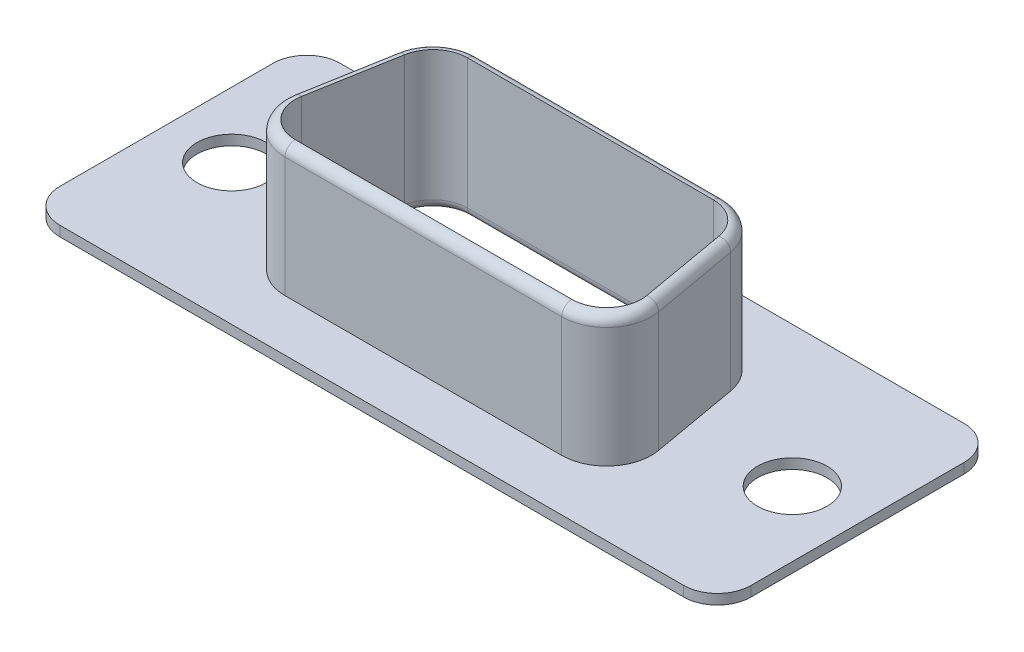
ISO-10303-21;
HEADER;
FILE_DESCRIPTION(('STEP AP214'),'2;1');
FILE_NAME('part.step','',(''),(''),'','','');
FILE_SCHEMA(('AUTOMOTIVE_DESIGN { 1 0 10303 214 1 1 1 1 }'));
ENDSEC;
DATA;
#1=APPLICATION_CONTEXT('core data for automotive mechanical design processes');
#2=APPLICATION_PROTOCOL_DEFINITION('international standard','automotive_design',2000,#1);
#3=PRODUCT_CONTEXT('',#1,'mechanical');
#4=PRODUCT('Part','Part','',(#3));
#5=PRODUCT_RELATED_PRODUCT_CATEGORY('part','',(#4));
#6=PRODUCT_DEFINITION_FORMATION('','',#4);
#7=PRODUCT_DEFINITION_CONTEXT('part definition',#1,'design');
#8=PRODUCT_DEFINITION('design','',#6,#7);
#9=PRODUCT_DEFINITION_SHAPE('','',#8);
#10=(LENGTH_UNIT() NAMED_UNIT(*) SI_UNIT(.MILLI.,.METRE.));
#11=(NAMED_UNIT(*) PLANE_ANGLE_UNIT() SI_UNIT($,.RADIAN.));
#12=(NAMED_UNIT(*) SI_UNIT($,.STERADIAN.) SOLID_ANGLE_UNIT());
#13=UNCERTAINTY_MEASURE_WITH_UNIT(LENGTH_MEASURE(1.E-05),#10,'distance_accuracy_value','');
#14=(GEOMETRIC_REPRESENTATION_CONTEXT(3) GLOBAL_UNCERTAINTY_ASSIGNED_CONTEXT((#13)) GLOBAL_UNIT_ASSIGNED_CONTEXT((#10,
#11,#12)) REPRESENTATION_CONTEXT('',''));
#15=CARTESIAN_POINT('',(0.,0.,0.));
#16=DIRECTION('',(0.,0.,1.));
#17=DIRECTION('',(1.,0.,0.));
#18=AXIS2_PLACEMENT_3D('',#15,#16,#17);
#19=CARTESIAN_POINT('',(6.165,6.25,1.95));
#20=DIRECTION('',(0.,-1.,0.));
#21=DIRECTION('',(1.,0.,0.));
#22=AXIS2_PLACEMENT_3D('',#19,#20,#21);
#23=CYLINDRICAL_SURFACE('',#22,1.55);
#24=CARTESIAN_POINT('',(6.165,0.45,1.95));
#25=DIRECTION('',(0.,1.,0.));
#26=DIRECTION('',(0.,0.,-1.));
#27=AXIS2_PLACEMENT_3D('',#24,#25,#26);
#28=CIRCLE('',#27,1.55);
#29=CARTESIAN_POINT('',(6.165,0.45,3.5));
#30=VERTEX_POINT('',#29);
#31=CARTESIAN_POINT('',(7.69145201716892,0.449999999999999,1.68084532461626));
#32=VERTEX_POINT('',#31);
#33=EDGE_CURVE('E192',#30,#32,#28,.T.);
#34=ORIENTED_EDGE('',*,*,#33,.F.);
#35=DIRECTION('',(0.,-1.,0.));
#36=VECTOR('',#35,1.);
#37=CARTESIAN_POINT('',(6.165,6.25,3.5));
#38=LINE('',#37,#36);
#39=CARTESIAN_POINT('',(6.165,6.25,3.5));
#40=VERTEX_POINT('',#39);
#41=EDGE_CURVE('E195',#30,#40,#38,.F.);
#42=ORIENTED_EDGE('',*,*,#41,.T.);
#43=CARTESIAN_POINT('',(6.165,6.25,1.95));
#44=DIRECTION('',(0.,-1.,0.));
#45=DIRECTION('',(0.,0.,1.));
#46=AXIS2_PLACEMENT_3D('',#43,#44,#45);
#47=CIRCLE('',#46,1.55);
#48=CARTESIAN_POINT('',(7.69145201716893,6.25,1.68084532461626));
#49=VERTEX_POINT('',#48);
#50=EDGE_CURVE('E500',#49,#40,#47,.T.);
#51=ORIENTED_EDGE('',*,*,#50,.F.);
#52=DIRECTION('',(0.,1.,0.));
#53=VECTOR('',#52,1.);
#54=CARTESIAN_POINT('',(7.69145201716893,6.25,1.68084532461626));
#55=LINE('',#54,#53);
#56=EDGE_CURVE('E198',#49,#32,#55,.F.);
#57=ORIENTED_EDGE('',*,*,#56,.T.);
#58=EDGE_LOOP('',(#34,#42,#51,#57));
#59=FACE_BOUND('',#58,.T.);
#60=ADVANCED_FACE('F19',(#59),#23,.F.);
#61=CARTESIAN_POINT('',(6.165,6.25,3.5));
#62=DIRECTION('',(0.,0.,1.));
#63=DIRECTION('',(0.,-1.,0.));
#64=AXIS2_PLACEMENT_3D('',#61,#62,#63);
#65=PLANE('',#64);
#66=DIRECTION('',(-1.,0.,0.));
#67=VECTOR('',#66,1.);
#68=CARTESIAN_POINT('',(6.165,0.45,3.5));
#69=LINE('',#68,#67);
#70=CARTESIAN_POINT('',(-6.165,0.450000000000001,3.5));
#71=VERTEX_POINT('',#70);
#72=EDGE_CURVE('E213',#71,#30,#69,.F.);
#73=ORIENTED_EDGE('',*,*,#72,.F.);
#74=DIRECTION('',(0.,-1.,0.));
#75=VECTOR('',#74,1.);
#76=CARTESIAN_POINT('',(-6.165,6.25,3.5));
#77=LINE('',#76,#75);
#78=CARTESIAN_POINT('',(-6.165,6.25,3.5));
#79=VERTEX_POINT('',#78);
#80=EDGE_CURVE('E222',#71,#79,#77,.F.);
#81=ORIENTED_EDGE('',*,*,#80,.T.);
#82=DIRECTION('',(1.,0.,0.));
#83=VECTOR('',#82,1.);
#84=CARTESIAN_POINT('',(6.165,6.25,3.5));
#85=LINE('',#84,#83);
#86=EDGE_CURVE('E220',#40,#79,#85,.F.);
#87=ORIENTED_EDGE('',*,*,#86,.F.);
#88=ORIENTED_EDGE('',*,*,#41,.F.);
#89=EDGE_LOOP('',(#73,#81,#87,#88));
#90=FACE_BOUND('',#89,.T.);
#91=ADVANCED_FACE('F217',(#90),#65,.F.);
#92=CARTESIAN_POINT('',(-6.165,6.25,1.95));
#93=DIRECTION('',(0.,-1.,0.));
#94=DIRECTION('',(1.,0.,0.));
#95=AXIS2_PLACEMENT_3D('',#92,#93,#94);
#96=CYLINDRICAL_SURFACE('',#95,1.55);
#97=CARTESIAN_POINT('',(-6.165,0.45,1.95));
#98=DIRECTION('',(0.,1.,0.));
#99=DIRECTION('',(0.,0.,-1.));
#100=AXIS2_PLACEMENT_3D('',#97,#98,#99);
#101=CIRCLE('',#100,1.55);
#102=CARTESIAN_POINT('',(-7.69145201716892,0.450000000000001,1.68084532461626));
#103=VERTEX_POINT('',#102);
#104=EDGE_CURVE('E229',#103,#71,#101,.T.);
#105=ORIENTED_EDGE('',*,*,#104,.F.);
#106=DIRECTION('',(0.,1.,0.));
#107=VECTOR('',#106,1.);
#108=CARTESIAN_POINT('',(-7.69145201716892,6.25,1.68084532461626));
#109=LINE('',#108,#107);
#110=CARTESIAN_POINT('',(-7.69145201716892,6.25,1.68084532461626));
#111=VERTEX_POINT('',#110);
#112=EDGE_CURVE('E635',#103,#111,#109,.T.);
#113=ORIENTED_EDGE('',*,*,#112,.T.);
#114=CARTESIAN_POINT('',(-6.165,6.25,1.95));
#115=DIRECTION('',(0.,-1.,0.));
#116=DIRECTION('',(0.,0.,1.));
#117=AXIS2_PLACEMENT_3D('',#114,#115,#116);
#118=CIRCLE('',#117,1.55);
#119=EDGE_CURVE('E460',#79,#111,#118,.T.);
#120=ORIENTED_EDGE('',*,*,#119,.F.);
#121=ORIENTED_EDGE('',*,*,#80,.F.);
#122=EDGE_LOOP('',(#105,#113,#120,#121));
#123=FACE_BOUND('',#122,.T.);
#124=ADVANCED_FACE('F676',(#123),#96,.F.);
#125=CARTESIAN_POINT('',(-7.69145201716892,6.25,1.68084532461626));
#126=DIRECTION('',(-0.984807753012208,0.,-0.17364817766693));
#127=DIRECTION('',(-0.17364817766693,0.,0.984807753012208));
#128=AXIS2_PLACEMENT_3D('',#125,#126,#127);
#129=PLANE('',#128);
#130=DIRECTION('',(0.17364817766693,0.,-0.984807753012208));
#131=VECTOR('',#130,1.);
#132=CARTESIAN_POINT('',(-7.69145201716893,0.450000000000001,1.68084532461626));
#133=LINE('',#132,#131);
#134=CARTESIAN_POINT('',(-7.00377679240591,0.450000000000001,-2.21915467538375));
#135=VERTEX_POINT('',#134);
#136=EDGE_CURVE('E528',#135,#103,#133,.F.);
#137=ORIENTED_EDGE('',*,*,#136,.F.);
#138=DIRECTION('',(0.,-1.,0.));
#139=VECTOR('',#138,1.);
#140=CARTESIAN_POINT('',(-7.00377679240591,6.25,-2.21915467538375));
#141=LINE('',#140,#139);
#142=CARTESIAN_POINT('',(-7.00377679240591,6.25,-2.21915467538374));
#143=VERTEX_POINT('',#142);
#144=EDGE_CURVE('E627',#135,#143,#141,.F.);
#145=ORIENTED_EDGE('',*,*,#144,.T.);
#146=DIRECTION('',(-0.17364817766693,0.,0.984807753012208));
#147=VECTOR('',#146,1.);
#148=CARTESIAN_POINT('',(-7.69145201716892,6.25,1.68084532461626));
#149=LINE('',#148,#147);
#150=EDGE_CURVE('E447',#111,#143,#149,.F.);
#151=ORIENTED_EDGE('',*,*,#150,.F.);
#152=ORIENTED_EDGE('',*,*,#112,.F.);
#153=EDGE_LOOP('',(#137,#145,#151,#152));
#154=FACE_BOUND('',#153,.T.);
#155=ADVANCED_FACE('F1155',(#154),#129,.F.);
#156=CARTESIAN_POINT('',(-5.47732477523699,6.25,-1.95));
#157=DIRECTION('',(0.,-1.,0.));
#158=DIRECTION('',(1.,0.,0.));
#159=AXIS2_PLACEMENT_3D('',#156,#157,#158);
#160=CYLINDRICAL_SURFACE('',#159,1.55);
#161=CARTESIAN_POINT('',(-5.47732477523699,0.450000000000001,-1.95));
#162=DIRECTION('',(0.,1.,0.));
#163=DIRECTION('',(0.,0.,-1.));
#164=AXIS2_PLACEMENT_3D('',#161,#162,#163);
#165=CIRCLE('',#164,1.55);
#166=CARTESIAN_POINT('',(-5.47732477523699,0.45,-3.5));
#167=VERTEX_POINT('',#166);
#168=EDGE_CURVE('E507',#167,#135,#165,.T.);
#169=ORIENTED_EDGE('',*,*,#168,.F.);
#170=DIRECTION('',(0.,1.,0.));
#171=VECTOR('',#170,1.);
#172=CARTESIAN_POINT('',(-5.47732477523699,6.25,-3.5));
#173=LINE('',#172,#171);
#174=CARTESIAN_POINT('',(-5.47732477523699,6.25,-3.5));
#175=VERTEX_POINT('',#174);
#176=EDGE_CURVE('E617',#167,#175,#173,.T.);
#177=ORIENTED_EDGE('',*,*,#176,.T.);
#178=CARTESIAN_POINT('',(-5.47732477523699,6.25,-1.95));
#179=DIRECTION('',(0.,-1.,0.));
#180=DIRECTION('',(0.,0.,1.));
#181=AXIS2_PLACEMENT_3D('',#178,#179,#180);
#182=CIRCLE('',#181,1.55);
#183=EDGE_CURVE('E446',#143,#175,#182,.T.);
#184=ORIENTED_EDGE('',*,*,#183,.F.);
#185=ORIENTED_EDGE('',*,*,#144,.F.);
#186=EDGE_LOOP('',(#169,#177,#184,#185));
#187=FACE_BOUND('',#186,.T.);
#188=ADVANCED_FACE('F1145',(#187),#160,.F.);
#189=CARTESIAN_POINT('',(-5.47732477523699,6.25,-3.5));
#190=DIRECTION('',(0.,0.,-1.));
#191=DIRECTION('',(-1.,0.,0.));
#192=AXIS2_PLACEMENT_3D('',#189,#190,#191);
#193=PLANE('',#192);
#194=DIRECTION('',(1.,0.,0.));
#195=VECTOR('',#194,1.);
#196=CARTESIAN_POINT('',(-5.47732477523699,0.45,-3.5));
#197=LINE('',#196,#195);
#198=CARTESIAN_POINT('',(5.47732477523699,0.45,-3.5));
#199=VERTEX_POINT('',#198);
#200=EDGE_CURVE('E501',#199,#167,#197,.F.);
#201=ORIENTED_EDGE('',*,*,#200,.F.);
#202=DIRECTION('',(0.,-1.,0.));
#203=VECTOR('',#202,1.);
#204=CARTESIAN_POINT('',(5.47732477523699,6.25,-3.5));
#205=LINE('',#204,#203);
#206=CARTESIAN_POINT('',(5.47732477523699,6.25,-3.5));
#207=VERTEX_POINT('',#206);
#208=EDGE_CURVE('E613',#199,#207,#205,.F.);
#209=ORIENTED_EDGE('',*,*,#208,.T.);
#210=DIRECTION('',(-1.,0.,0.));
#211=VECTOR('',#210,1.);
#212=CARTESIAN_POINT('',(-5.47732477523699,6.25,-3.5));
#213=LINE('',#212,#211);
#214=EDGE_CURVE('E620',#175,#207,#213,.F.);
#215=ORIENTED_EDGE('',*,*,#214,.F.);
#216=ORIENTED_EDGE('',*,*,#176,.F.);
#217=EDGE_LOOP('',(#201,#209,#215,#216));
#218=FACE_BOUND('',#217,.T.);
#219=ADVANCED_FACE('F1136',(#218),#193,.F.);
#220=CARTESIAN_POINT('',(5.47732477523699,6.25,-1.95));
#221=DIRECTION('',(0.,-1.,0.));
#222=DIRECTION('',(1.,0.,0.));
#223=AXIS2_PLACEMENT_3D('',#220,#221,#222);
#224=CYLINDRICAL_SURFACE('',#223,1.55);
#225=CARTESIAN_POINT('',(5.47732477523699,0.45,-1.95));
#226=DIRECTION('',(0.,1.,0.));
#227=DIRECTION('',(0.,0.,-1.));
#228=AXIS2_PLACEMENT_3D('',#225,#226,#227);
#229=CIRCLE('',#228,1.55);
#230=CARTESIAN_POINT('',(7.00377679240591,0.449999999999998,-2.21915467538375));
#231=VERTEX_POINT('',#230);
#232=EDGE_CURVE('E243',#231,#199,#229,.T.);
#233=ORIENTED_EDGE('',*,*,#232,.F.);
#234=DIRECTION('',(0.,1.,0.));
#235=VECTOR('',#234,1.);
#236=CARTESIAN_POINT('',(7.00377679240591,6.25,-2.21915467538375));
#237=LINE('',#236,#235);
#238=CARTESIAN_POINT('',(7.00377679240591,6.25,-2.21915467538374));
#239=VERTEX_POINT('',#238);
#240=EDGE_CURVE('E604',#231,#239,#237,.T.);
#241=ORIENTED_EDGE('',*,*,#240,.T.);
#242=CARTESIAN_POINT('',(5.47732477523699,6.25,-1.95));
#243=DIRECTION('',(0.,-1.,0.));
#244=DIRECTION('',(0.,0.,1.));
#245=AXIS2_PLACEMENT_3D('',#242,#243,#244);
#246=CIRCLE('',#245,1.55);
#247=EDGE_CURVE('E406',#207,#239,#246,.T.);
#248=ORIENTED_EDGE('',*,*,#247,.F.);
#249=ORIENTED_EDGE('',*,*,#208,.F.);
#250=EDGE_LOOP('',(#233,#241,#248,#249));
#251=FACE_BOUND('',#250,.T.);
#252=ADVANCED_FACE('F1127',(#251),#224,.F.);
#253=CARTESIAN_POINT('',(7.00377679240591,6.25,-2.21915467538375));
#254=DIRECTION('',(0.984807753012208,0.,-0.173648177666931));
#255=DIRECTION('',(-0.173648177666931,0.,-0.984807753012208));
#256=AXIS2_PLACEMENT_3D('',#253,#254,#255);
#257=PLANE('',#256);
#258=DIRECTION('',(0.173648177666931,0.,0.984807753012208));
#259=VECTOR('',#258,1.);
#260=CARTESIAN_POINT('',(7.00377679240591,0.449999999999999,-2.21915467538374));
#261=LINE('',#260,#259);
#262=EDGE_CURVE('E239',#32,#231,#261,.F.);
#263=ORIENTED_EDGE('',*,*,#262,.F.);
#264=ORIENTED_EDGE('',*,*,#56,.F.);
#265=DIRECTION('',(-0.173648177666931,0.,-0.984807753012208));
#266=VECTOR('',#265,1.);
#267=CARTESIAN_POINT('',(7.00377679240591,6.25,-2.21915467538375));
#268=LINE('',#267,#266);
#269=EDGE_CURVE('E411',#239,#49,#268,.F.);
#270=ORIENTED_EDGE('',*,*,#269,.F.);
#271=ORIENTED_EDGE('',*,*,#240,.F.);
#272=EDGE_LOOP('',(#263,#264,#270,#271));
#273=FACE_BOUND('',#272,.T.);
#274=ADVANCED_FACE('F585',(#273),#257,.F.);
#275=CARTESIAN_POINT('',(5.47732477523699,0.45,-1.95));
#276=DIRECTION('',(0.,1.,0.));
#277=DIRECTION('',(0.,0.,-1.));
#278=AXIS2_PLACEMENT_3D('',#275,#276,#277);
#279=TOROIDAL_SURFACE('',#278,2.,0.45);
#280=CARTESIAN_POINT('',(5.47732477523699,0.45,-3.95));
#281=DIRECTION('',(1.,0.,0.));
#282=DIRECTION('',(0.,0.,-1.));
#283=AXIS2_PLACEMENT_3D('',#280,#281,#282);
#284=CIRCLE('',#283,0.45);
#285=CARTESIAN_POINT('',(5.47732477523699,0.,-3.95));
#286=VERTEX_POINT('',#285);
#287=EDGE_CURVE('E504',#286,#199,#284,.F.);
#288=ORIENTED_EDGE('',*,*,#287,.F.);
#289=CARTESIAN_POINT('',(5.47732477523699,0.,-1.95));
#290=DIRECTION('',(0.,-1.,0.));
#291=DIRECTION('',(0.,0.,-1.));
#292=AXIS2_PLACEMENT_3D('',#289,#290,#291);
#293=CIRCLE('',#292,2.);
#294=CARTESIAN_POINT('',(7.4469402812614,0.,-2.29729635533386));
#295=VERTEX_POINT('',#294);
#296=EDGE_CURVE('E321',#286,#295,#293,.T.);
#297=ORIENTED_EDGE('',*,*,#296,.T.);
#298=CARTESIAN_POINT('',(7.4469402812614,0.45,-2.29729635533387));
#299=DIRECTION('',(0.173648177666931,0.,0.984807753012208));
#300=DIRECTION('',(0.984807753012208,0.,-0.173648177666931));
#301=AXIS2_PLACEMENT_3D('',#298,#299,#300);
#302=CIRCLE('',#301,0.45);
#303=EDGE_CURVE('E242',#231,#295,#302,.T.);
#304=ORIENTED_EDGE('',*,*,#303,.F.);
#305=ORIENTED_EDGE('',*,*,#232,.T.);
#306=EDGE_LOOP('',(#288,#297,#304,#305));
#307=FACE_BOUND('',#306,.T.);
#308=ADVANCED_FACE('F581',(#307),#279,.T.);
#309=CARTESIAN_POINT('',(7.4469402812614,0.45,-2.29729635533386));
#310=DIRECTION('',(0.173648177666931,0.,0.984807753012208));
#311=DIRECTION('',(0.984807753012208,0.,-0.173648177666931));
#312=AXIS2_PLACEMENT_3D('',#309,#310,#311);
#313=CYLINDRICAL_SURFACE('',#312,0.45);
#314=ORIENTED_EDGE('',*,*,#303,.T.);
#315=DIRECTION('',(0.173648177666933,0.,0.984807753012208));
#316=VECTOR('',#315,1.);
#317=CARTESIAN_POINT('',(7.4469402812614,0.,-2.29729635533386));
#318=LINE('',#317,#316);
#319=CARTESIAN_POINT('',(8.13461550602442,0.,1.60270364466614));
#320=VERTEX_POINT('',#319);
#321=EDGE_CURVE('E386',#295,#320,#318,.T.);
#322=ORIENTED_EDGE('',*,*,#321,.T.);
#323=CARTESIAN_POINT('',(8.13461550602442,0.449999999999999,1.60270364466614));
#324=DIRECTION('',(-0.173648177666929,0.,-0.984807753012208));
#325=DIRECTION('',(0.984807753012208,0.,-0.173648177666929));
#326=AXIS2_PLACEMENT_3D('',#323,#324,#325);
#327=CIRCLE('',#326,0.45);
#328=EDGE_CURVE('E203',#32,#320,#327,.F.);
#329=ORIENTED_EDGE('',*,*,#328,.F.);
#330=ORIENTED_EDGE('',*,*,#262,.T.);
#331=EDGE_LOOP('',(#314,#322,#329,#330));
#332=FACE_BOUND('',#331,.T.);
#333=ADVANCED_FACE('F561',(#332),#313,.T.);
#334=CARTESIAN_POINT('',(6.165,0.45,1.95));
#335=DIRECTION('',(0.,1.,0.));
#336=DIRECTION('',(0.,0.,-1.));
#337=AXIS2_PLACEMENT_3D('',#334,#335,#336);
#338=TOROIDAL_SURFACE('',#337,2.,0.45);
#339=CARTESIAN_POINT('',(6.165,0.45,3.95));
#340=DIRECTION('',(-1.,0.,0.));
#341=DIRECTION('',(0.,0.,1.));
#342=AXIS2_PLACEMENT_3D('',#339,#340,#341);
#343=CIRCLE('',#342,0.45);
#344=CARTESIAN_POINT('',(6.165,0.,3.95));
#345=VERTEX_POINT('',#344);
#346=EDGE_CURVE('E202',#30,#345,#343,.T.);
#347=ORIENTED_EDGE('',*,*,#346,.F.);
#348=ORIENTED_EDGE('',*,*,#33,.T.);
#349=ORIENTED_EDGE('',*,*,#328,.T.);
#350=CARTESIAN_POINT('',(6.165,0.,1.95));
#351=DIRECTION('',(0.,-1.,0.));
#352=DIRECTION('',(0.984807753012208,0.,-0.173648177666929));
#353=AXIS2_PLACEMENT_3D('',#350,#351,#352);
#354=CIRCLE('',#353,2.);
#355=EDGE_CURVE('E208',#320,#345,#354,.T.);
#356=ORIENTED_EDGE('',*,*,#355,.T.);
#357=EDGE_LOOP('',(#347,#348,#349,#356));
#358=FACE_BOUND('',#357,.T.);
#359=ADVANCED_FACE('F206',(#358),#338,.T.);
#360=CARTESIAN_POINT('',(6.165,0.45,3.95));
#361=DIRECTION('',(-1.,0.,0.));
#362=DIRECTION('',(0.,0.,1.));
#363=AXIS2_PLACEMENT_3D('',#360,#361,#362);
#364=CYLINDRICAL_SURFACE('',#363,0.45);
#365=CARTESIAN_POINT('',(-6.165,0.450000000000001,3.95));
#366=DIRECTION('',(1.,0.,0.));
#367=DIRECTION('',(0.,0.,1.));
#368=AXIS2_PLACEMENT_3D('',#365,#366,#367);
#369=CIRCLE('',#368,0.45);
#370=CARTESIAN_POINT('',(-6.165,0.,3.95));
#371=VERTEX_POINT('',#370);
#372=EDGE_CURVE('E226',#71,#371,#369,.F.);
#373=ORIENTED_EDGE('',*,*,#372,.F.);
#374=ORIENTED_EDGE('',*,*,#72,.T.);
#375=ORIENTED_EDGE('',*,*,#346,.T.);
#376=DIRECTION('',(1.,0.,0.));
#377=VECTOR('',#376,1.);
#378=CARTESIAN_POINT('',(15.405,0.,3.95));
#379=LINE('',#378,#377);
#380=EDGE_CURVE('E377',#345,#371,#379,.F.);
#381=ORIENTED_EDGE('',*,*,#380,.T.);
#382=EDGE_LOOP('',(#373,#374,#375,#381));
#383=FACE_BOUND('',#382,.T.);
#384=ADVANCED_FACE('F224',(#383),#364,.T.);
#385=CARTESIAN_POINT('',(-6.165,0.45,1.95));
#386=DIRECTION('',(0.,1.,0.));
#387=DIRECTION('',(0.,0.,-1.));
#388=AXIS2_PLACEMENT_3D('',#385,#386,#387);
#389=TOROIDAL_SURFACE('',#388,2.,0.45);
#390=CARTESIAN_POINT('',(-8.13461550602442,0.450000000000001,1.60270364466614));
#391=DIRECTION('',(0.17364817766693,0.,-0.984807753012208));
#392=DIRECTION('',(-0.984807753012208,0.,-0.17364817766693));
#393=AXIS2_PLACEMENT_3D('',#390,#391,#392);
#394=CIRCLE('',#393,0.45);
#395=CARTESIAN_POINT('',(-8.13461550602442,0.,1.60270364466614));
#396=VERTEX_POINT('',#395);
#397=EDGE_CURVE('E531',#103,#396,#394,.T.);
#398=ORIENTED_EDGE('',*,*,#397,.F.);
#399=ORIENTED_EDGE('',*,*,#104,.T.);
#400=ORIENTED_EDGE('',*,*,#372,.T.);
#401=CARTESIAN_POINT('',(-6.165,0.,1.95));
#402=DIRECTION('',(0.,-1.,0.));
#403=DIRECTION('',(0.,0.,1.));
#404=AXIS2_PLACEMENT_3D('',#401,#402,#403);
#405=CIRCLE('',#404,2.);
#406=EDGE_CURVE('E361',#371,#396,#405,.T.);
#407=ORIENTED_EDGE('',*,*,#406,.T.);
#408=EDGE_LOOP('',(#398,#399,#400,#407));
#409=FACE_BOUND('',#408,.T.);
#410=ADVANCED_FACE('F538',(#409),#389,.T.);
#411=CARTESIAN_POINT('',(-8.13461550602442,0.450000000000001,1.60270364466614));
#412=DIRECTION('',(0.17364817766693,0.,-0.984807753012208));
#413=DIRECTION('',(-0.984807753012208,0.,-0.17364817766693));
#414=AXIS2_PLACEMENT_3D('',#411,#412,#413);
#415=CYLINDRICAL_SURFACE('',#414,0.45);
#416=CARTESIAN_POINT('',(-7.4469402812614,0.450000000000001,-2.29729635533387));
#417=DIRECTION('',(-0.173648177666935,0.,0.984807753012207));
#418=DIRECTION('',(-0.984807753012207,0.,-0.173648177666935));
#419=AXIS2_PLACEMENT_3D('',#416,#417,#418);
#420=CIRCLE('',#419,0.45);
#421=CARTESIAN_POINT('',(-7.4469402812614,0.,-2.29729635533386));
#422=VERTEX_POINT('',#421);
#423=EDGE_CURVE('E521',#135,#422,#420,.F.);
#424=ORIENTED_EDGE('',*,*,#423,.F.);
#425=ORIENTED_EDGE('',*,*,#136,.T.);
#426=ORIENTED_EDGE('',*,*,#397,.T.);
#427=DIRECTION('',(0.173648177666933,0.,-0.984807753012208));
#428=VECTOR('',#427,1.);
#429=CARTESIAN_POINT('',(-8.13461550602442,0.,1.60270364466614));
#430=LINE('',#429,#428);
#431=EDGE_CURVE('E369',#396,#422,#430,.T.);
#432=ORIENTED_EDGE('',*,*,#431,.T.);
#433=EDGE_LOOP('',(#424,#425,#426,#432));
#434=FACE_BOUND('',#433,.T.);
#435=ADVANCED_FACE('F516',(#434),#415,.T.);
#436=CARTESIAN_POINT('',(-5.47732477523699,0.45,-1.95));
#437=DIRECTION('',(0.,1.,0.));
#438=DIRECTION('',(0.,0.,-1.));
#439=AXIS2_PLACEMENT_3D('',#436,#437,#438);
#440=TOROIDAL_SURFACE('',#439,2.,0.45);
#441=CARTESIAN_POINT('',(-5.47732477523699,0.45,-3.95));
#442=DIRECTION('',(1.,0.,0.));
#443=DIRECTION('',(0.,0.,-1.));
#444=AXIS2_PLACEMENT_3D('',#441,#442,#443);
#445=CIRCLE('',#444,0.45);
#446=CARTESIAN_POINT('',(-5.47732477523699,0.,-3.95));
#447=VERTEX_POINT('',#446);
#448=EDGE_CURVE('E498',#167,#447,#445,.T.);
#449=ORIENTED_EDGE('',*,*,#448,.F.);
#450=ORIENTED_EDGE('',*,*,#168,.T.);
#451=ORIENTED_EDGE('',*,*,#423,.T.);
#452=CARTESIAN_POINT('',(-5.47732477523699,0.,-1.95));
#453=DIRECTION('',(0.,-1.,0.));
#454=DIRECTION('',(-0.984807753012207,0.,-0.173648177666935));
#455=AXIS2_PLACEMENT_3D('',#452,#453,#454);
#456=CIRCLE('',#455,2.);
#457=EDGE_CURVE('E118',#422,#447,#456,.T.);
#458=ORIENTED_EDGE('',*,*,#457,.T.);
#459=EDGE_LOOP('',(#449,#450,#451,#458));
#460=FACE_BOUND('',#459,.T.);
#461=ADVANCED_FACE('F512',(#460),#440,.T.);
#462=CARTESIAN_POINT('',(-5.47732477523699,0.45,-3.95));
#463=DIRECTION('',(1.,0.,0.));
#464=DIRECTION('',(0.,0.,-1.));
#465=AXIS2_PLACEMENT_3D('',#462,#463,#464);
#466=CYLINDRICAL_SURFACE('',#465,0.45);
#467=ORIENTED_EDGE('',*,*,#448,.T.);
#468=DIRECTION('',(1.,0.,0.));
#469=VECTOR('',#468,1.);
#470=CARTESIAN_POINT('',(15.405,0.,-3.95));
#471=LINE('',#470,#469);
#472=EDGE_CURVE('E371',#447,#286,#471,.T.);
#473=ORIENTED_EDGE('',*,*,#472,.T.);
#474=ORIENTED_EDGE('',*,*,#287,.T.);
#475=ORIENTED_EDGE('',*,*,#200,.T.);
#476=EDGE_LOOP('',(#467,#473,#474,#475));
#477=FACE_BOUND('',#476,.T.);
#478=ADVANCED_FACE('F485',(#477),#466,.T.);
#479=CARTESIAN_POINT('',(6.165,5.8,1.95));
#480=DIRECTION('',(0.,-1.,0.));
#481=DIRECTION('',(0.,0.,1.));
#482=AXIS2_PLACEMENT_3D('',#479,#480,#481);
#483=TOROIDAL_SURFACE('',#482,1.55,0.45);
#484=CARTESIAN_POINT('',(6.165,5.8,3.5));
#485=DIRECTION('',(1.,0.,0.));
#486=DIRECTION('',(0.,0.,-1.));
#487=AXIS2_PLACEMENT_3D('',#484,#485,#486);
#488=CIRCLE('',#487,0.45);
#489=CARTESIAN_POINT('',(6.165,5.8,3.95));
#490=VERTEX_POINT('',#489);
#491=EDGE_CURVE('E609',#490,#40,#488,.F.);
#492=ORIENTED_EDGE('',*,*,#491,.F.);
#493=CARTESIAN_POINT('',(6.165,5.8,1.95));
#494=DIRECTION('',(0.,-1.,0.));
#495=DIRECTION('',(1.,0.,0.));
#496=AXIS2_PLACEMENT_3D('',#493,#494,#495);
#497=CIRCLE('',#496,2.);
#498=CARTESIAN_POINT('',(8.13461550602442,5.8,1.60270364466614));
#499=VERTEX_POINT('',#498);
#500=EDGE_CURVE('E390',#499,#490,#497,.T.);
#501=ORIENTED_EDGE('',*,*,#500,.F.);
#502=CARTESIAN_POINT('',(7.69145201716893,5.8,1.68084532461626));
#503=DIRECTION('',(-0.173648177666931,0.,-0.984807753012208));
#504=DIRECTION('',(-0.984807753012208,0.,0.173648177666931));
#505=AXIS2_PLACEMENT_3D('',#502,#503,#504);
#506=CIRCLE('',#505,0.45);
#507=EDGE_CURVE('E402',#49,#499,#506,.T.);
#508=ORIENTED_EDGE('',*,*,#507,.F.);
#509=ORIENTED_EDGE('',*,*,#50,.T.);
#510=EDGE_LOOP('',(#492,#501,#508,#509));
#511=FACE_BOUND('',#510,.T.);
#512=ADVANCED_FACE('F480',(#511),#483,.T.);
#513=CARTESIAN_POINT('',(6.165,5.8,3.5));
#514=DIRECTION('',(1.,0.,0.));
#515=DIRECTION('',(0.,0.,-1.));
#516=AXIS2_PLACEMENT_3D('',#513,#514,#515);
#517=CYLINDRICAL_SURFACE('',#516,0.45);
#518=CARTESIAN_POINT('',(-6.165,5.8,3.5));
#519=DIRECTION('',(-1.,0.,0.));
#520=DIRECTION('',(0.,0.,1.));
#521=AXIS2_PLACEMENT_3D('',#518,#519,#520);
#522=CIRCLE('',#521,0.45);
#523=CARTESIAN_POINT('',(-6.165,5.8,3.95));
#524=VERTEX_POINT('',#523);
#525=EDGE_CURVE('E471',#524,#79,#522,.T.);
#526=ORIENTED_EDGE('',*,*,#525,.F.);
#527=DIRECTION('',(1.,0.,0.));
#528=VECTOR('',#527,1.);
#529=CARTESIAN_POINT('',(6.165,5.8,3.95));
#530=LINE('',#529,#528);
#531=EDGE_CURVE('E684',#490,#524,#530,.F.);
#532=ORIENTED_EDGE('',*,*,#531,.F.);
#533=ORIENTED_EDGE('',*,*,#491,.T.);
#534=ORIENTED_EDGE('',*,*,#86,.T.);
#535=EDGE_LOOP('',(#526,#532,#533,#534));
#536=FACE_BOUND('',#535,.T.);
#537=ADVANCED_FACE('F476',(#536),#517,.T.);
#538=CARTESIAN_POINT('',(-6.165,5.8,1.95));
#539=DIRECTION('',(0.,-1.,0.));
#540=DIRECTION('',(0.,0.,1.));
#541=AXIS2_PLACEMENT_3D('',#538,#539,#540);
#542=TOROIDAL_SURFACE('',#541,1.55,0.45);
#543=CARTESIAN_POINT('',(-7.69145201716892,5.8,1.68084532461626));
#544=DIRECTION('',(-0.17364817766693,0.,0.984807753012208));
#545=DIRECTION('',(0.984807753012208,0.,0.17364817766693));
#546=AXIS2_PLACEMENT_3D('',#543,#544,#545);
#547=CIRCLE('',#546,0.45);
#548=CARTESIAN_POINT('',(-8.13461550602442,5.8,1.60270364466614));
#549=VERTEX_POINT('',#548);
#550=EDGE_CURVE('E457',#549,#111,#547,.F.);
#551=ORIENTED_EDGE('',*,*,#550,.F.);
#552=CARTESIAN_POINT('',(-6.165,5.8,1.95));
#553=DIRECTION('',(0.,-1.,0.));
#554=DIRECTION('',(1.,0.,0.));
#555=AXIS2_PLACEMENT_3D('',#552,#553,#554);
#556=CIRCLE('',#555,2.);
#557=EDGE_CURVE('E463',#524,#549,#556,.T.);
#558=ORIENTED_EDGE('',*,*,#557,.F.);
#559=ORIENTED_EDGE('',*,*,#525,.T.);
#560=ORIENTED_EDGE('',*,*,#119,.T.);
#561=EDGE_LOOP('',(#551,#558,#559,#560));
#562=FACE_BOUND('',#561,.T.);
#563=ADVANCED_FACE('F473',(#562),#542,.T.);
#564=CARTESIAN_POINT('',(-7.69145201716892,5.8,1.68084532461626));
#565=DIRECTION('',(-0.17364817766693,0.,0.984807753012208));
#566=DIRECTION('',(0.984807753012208,0.,0.17364817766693));
#567=AXIS2_PLACEMENT_3D('',#564,#565,#566);
#568=CYLINDRICAL_SURFACE('',#567,0.45);
#569=CARTESIAN_POINT('',(-7.00377679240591,5.8,-2.21915467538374));
#570=DIRECTION('',(0.17364817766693,0.,-0.984807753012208));
#571=DIRECTION('',(-0.984807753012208,0.,-0.17364817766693));
#572=AXIS2_PLACEMENT_3D('',#569,#570,#571);
#573=CIRCLE('',#572,0.45);
#574=CARTESIAN_POINT('',(-7.44694028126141,5.8,-2.29729635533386));
#575=VERTEX_POINT('',#574);
#576=EDGE_CURVE('E443',#575,#143,#573,.T.);
#577=ORIENTED_EDGE('',*,*,#576,.F.);
#578=DIRECTION('',(-0.17364817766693,0.,0.984807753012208));
#579=VECTOR('',#578,1.);
#580=CARTESIAN_POINT('',(-8.13461550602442,5.8,1.60270364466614));
#581=LINE('',#580,#579);
#582=EDGE_CURVE('E450',#549,#575,#581,.F.);
#583=ORIENTED_EDGE('',*,*,#582,.F.);
#584=ORIENTED_EDGE('',*,*,#550,.T.);
#585=ORIENTED_EDGE('',*,*,#150,.T.);
#586=EDGE_LOOP('',(#577,#583,#584,#585));
#587=FACE_BOUND('',#586,.T.);
#588=ADVANCED_FACE('F435',(#587),#568,.T.);
#589=CARTESIAN_POINT('',(-5.47732477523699,5.8,-1.95));
#590=DIRECTION('',(0.,-1.,0.));
#591=DIRECTION('',(0.,0.,1.));
#592=AXIS2_PLACEMENT_3D('',#589,#590,#591);
#593=TOROIDAL_SURFACE('',#592,1.55,0.45);
#594=CARTESIAN_POINT('',(-5.47732477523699,5.8,-3.5));
#595=DIRECTION('',(-1.,0.,0.));
#596=DIRECTION('',(0.,0.,1.));
#597=AXIS2_PLACEMENT_3D('',#594,#595,#596);
#598=CIRCLE('',#597,0.45);
#599=CARTESIAN_POINT('',(-5.47732477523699,5.8,-3.95));
#600=VERTEX_POINT('',#599);
#601=EDGE_CURVE('E623',#600,#175,#598,.F.);
#602=ORIENTED_EDGE('',*,*,#601,.F.);
#603=CARTESIAN_POINT('',(-5.47732477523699,5.8,-1.95));
#604=DIRECTION('',(0.,-1.,0.));
#605=DIRECTION('',(1.,0.,0.));
#606=AXIS2_PLACEMENT_3D('',#603,#604,#605);
#607=CIRCLE('',#606,2.);
#608=EDGE_CURVE('E744',#575,#600,#607,.T.);
#609=ORIENTED_EDGE('',*,*,#608,.F.);
#610=ORIENTED_EDGE('',*,*,#576,.T.);
#611=ORIENTED_EDGE('',*,*,#183,.T.);
#612=EDGE_LOOP('',(#602,#609,#610,#611));
#613=FACE_BOUND('',#612,.T.);
#614=ADVANCED_FACE('F430',(#613),#593,.T.);
#615=CARTESIAN_POINT('',(-5.47732477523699,5.8,-3.5));
#616=DIRECTION('',(-1.,0.,0.));
#617=DIRECTION('',(0.,0.,1.));
#618=AXIS2_PLACEMENT_3D('',#615,#616,#617);
#619=CYLINDRICAL_SURFACE('',#618,0.45);
#620=ORIENTED_EDGE('',*,*,#601,.T.);
#621=ORIENTED_EDGE('',*,*,#214,.T.);
#622=CARTESIAN_POINT('',(5.47732477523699,5.8,-3.5));
#623=DIRECTION('',(1.,0.,0.));
#624=DIRECTION('',(0.,0.,-1.));
#625=AXIS2_PLACEMENT_3D('',#622,#623,#624);
#626=CIRCLE('',#625,0.45);
#627=CARTESIAN_POINT('',(5.47732477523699,5.8,-3.95));
#628=VERTEX_POINT('',#627);
#629=EDGE_CURVE('E421',#628,#207,#626,.T.);
#630=ORIENTED_EDGE('',*,*,#629,.F.);
#631=DIRECTION('',(-1.,0.,0.));
#632=VECTOR('',#631,1.);
#633=CARTESIAN_POINT('',(-5.47732477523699,5.8,-3.95));
#634=LINE('',#633,#632);
#635=EDGE_CURVE('E738',#600,#628,#634,.F.);
#636=ORIENTED_EDGE('',*,*,#635,.F.);
#637=EDGE_LOOP('',(#620,#621,#630,#636));
#638=FACE_BOUND('',#637,.T.);
#639=ADVANCED_FACE('F426',(#638),#619,.T.);
#640=CARTESIAN_POINT('',(5.47732477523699,5.8,-1.95));
#641=DIRECTION('',(0.,-1.,0.));
#642=DIRECTION('',(0.,0.,1.));
#643=AXIS2_PLACEMENT_3D('',#640,#641,#642);
#644=TOROIDAL_SURFACE('',#643,1.55,0.45);
#645=ORIENTED_EDGE('',*,*,#629,.T.);
#646=ORIENTED_EDGE('',*,*,#247,.T.);
#647=CARTESIAN_POINT('',(7.00377679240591,5.8,-2.21915467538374));
#648=DIRECTION('',(-0.173648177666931,0.,-0.984807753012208));
#649=DIRECTION('',(-0.984807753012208,0.,0.173648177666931));
#650=AXIS2_PLACEMENT_3D('',#647,#648,#649);
#651=CIRCLE('',#650,0.45);
#652=CARTESIAN_POINT('',(7.4469402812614,5.8,-2.29729635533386));
#653=VERTEX_POINT('',#652);
#654=EDGE_CURVE('E405',#653,#239,#651,.F.);
#655=ORIENTED_EDGE('',*,*,#654,.F.);
#656=CARTESIAN_POINT('',(5.47732477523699,5.8,-1.95));
#657=DIRECTION('',(0.,-1.,0.));
#658=DIRECTION('',(1.,0.,0.));
#659=AXIS2_PLACEMENT_3D('',#656,#657,#658);
#660=CIRCLE('',#659,2.);
#661=EDGE_CURVE('E414',#628,#653,#660,.T.);
#662=ORIENTED_EDGE('',*,*,#661,.F.);
#663=EDGE_LOOP('',(#645,#646,#655,#662));
#664=FACE_BOUND('',#663,.T.);
#665=ADVANCED_FACE('F423',(#664),#644,.T.);
#666=CARTESIAN_POINT('',(7.00377679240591,5.8,-2.21915467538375));
#667=DIRECTION('',(-0.173648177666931,0.,-0.984807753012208));
#668=DIRECTION('',(-0.984807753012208,0.,0.173648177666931));
#669=AXIS2_PLACEMENT_3D('',#666,#667,#668);
#670=CYLINDRICAL_SURFACE('',#669,0.45);
#671=ORIENTED_EDGE('',*,*,#654,.T.);
#672=ORIENTED_EDGE('',*,*,#269,.T.);
#673=ORIENTED_EDGE('',*,*,#507,.T.);
#674=DIRECTION('',(-0.173648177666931,0.,-0.984807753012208));
#675=VECTOR('',#674,1.);
#676=CARTESIAN_POINT('',(7.4469402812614,5.8,-2.29729635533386));
#677=LINE('',#676,#675);
#678=EDGE_CURVE('E397',#653,#499,#677,.F.);
#679=ORIENTED_EDGE('',*,*,#678,.F.);
#680=EDGE_LOOP('',(#671,#672,#673,#679));
#681=FACE_BOUND('',#680,.T.);
#682=ADVANCED_FACE('F338',(#681),#670,.T.);
#683=CARTESIAN_POINT('',(15.405,0.,6.25));
#684=DIRECTION('',(0.,1.,0.));
#685=DIRECTION('',(0.,0.,1.));
#686=AXIS2_PLACEMENT_3D('',#683,#684,#685);
#687=PLANE('',#686);
#688=CARTESIAN_POINT('',(-12.495,0.,0.));
#689=DIRECTION('',(0.,-1.,0.));
#690=DIRECTION('',(1.,0.,0.));
#691=AXIS2_PLACEMENT_3D('',#688,#689,#690);
#692=CIRCLE('',#691,1.55);
#693=CARTESIAN_POINT('',(-10.945,0.,0.));
#694=VERTEX_POINT('',#693);
#695=EDGE_CURVE('E280',#694,#694,#692,.F.);
#696=ORIENTED_EDGE('',*,*,#695,.T.);
#697=EDGE_LOOP('',(#696));
#698=FACE_BOUND('',#697,.T.);
#699=CARTESIAN_POINT('',(12.495,0.,0.));
#700=DIRECTION('',(0.,-1.,0.));
#701=DIRECTION('',(1.,0.,0.));
#702=AXIS2_PLACEMENT_3D('',#699,#700,#701);
#703=CIRCLE('',#702,1.55);
#704=CARTESIAN_POINT('',(14.045,0.,0.));
#705=VERTEX_POINT('',#704);
#706=EDGE_CURVE('E283',#705,#705,#703,.F.);
#707=ORIENTED_EDGE('',*,*,#706,.T.);
#708=EDGE_LOOP('',(#707));
#709=FACE_BOUND('',#708,.T.);
#710=ORIENTED_EDGE('',*,*,#457,.F.);
#711=ORIENTED_EDGE('',*,*,#431,.F.);
#712=ORIENTED_EDGE('',*,*,#406,.F.);
#713=ORIENTED_EDGE('',*,*,#380,.F.);
#714=ORIENTED_EDGE('',*,*,#355,.F.);
#715=ORIENTED_EDGE('',*,*,#321,.F.);
#716=ORIENTED_EDGE('',*,*,#296,.F.);
#717=ORIENTED_EDGE('',*,*,#472,.F.);
#718=EDGE_LOOP('',(#710,#711,#712,#713,#714,#715,#716,#717));
#719=FACE_BOUND('',#718,.T.);
#720=CARTESIAN_POINT('',(-13.905,0.,-4.75));
#721=DIRECTION('',(0.,-1.,0.));
#722=DIRECTION('',(1.,0.,0.));
#723=AXIS2_PLACEMENT_3D('',#720,#721,#722);
#724=CIRCLE('',#723,1.5);
#725=CARTESIAN_POINT('',(-13.905,0.,-6.25));
#726=VERTEX_POINT('',#725);
#727=CARTESIAN_POINT('',(-15.405,0.,-4.75));
#728=VERTEX_POINT('',#727);
#729=EDGE_CURVE('E22',#726,#728,#724,.F.);
#730=ORIENTED_EDGE('',*,*,#729,.F.);
#731=DIRECTION('',(-1.,0.,0.));
#732=VECTOR('',#731,1.);
#733=CARTESIAN_POINT('',(15.405,0.,-6.25));
#734=LINE('',#733,#732);
#735=CARTESIAN_POINT('',(13.905,0.,-6.25));
#736=VERTEX_POINT('',#735);
#737=EDGE_CURVE('E372',#736,#726,#734,.T.);
#738=ORIENTED_EDGE('',*,*,#737,.F.);
#739=CARTESIAN_POINT('',(13.905,0.,-4.75));
#740=DIRECTION('',(0.,1.,0.));
#741=DIRECTION('',(-1.,0.,0.));
#742=AXIS2_PLACEMENT_3D('',#739,#740,#741);
#743=CIRCLE('',#742,1.5);
#744=CARTESIAN_POINT('',(15.405,0.,-4.75));
#745=VERTEX_POINT('',#744);
#746=EDGE_CURVE('E287',#745,#736,#743,.T.);
#747=ORIENTED_EDGE('',*,*,#746,.F.);
#748=DIRECTION('',(0.,0.,-1.));
#749=VECTOR('',#748,1.);
#750=CARTESIAN_POINT('',(15.405,0.,6.25));
#751=LINE('',#750,#749);
#752=CARTESIAN_POINT('',(15.405,0.,4.75));
#753=VERTEX_POINT('',#752);
#754=EDGE_CURVE('E493',#753,#745,#751,.T.);
#755=ORIENTED_EDGE('',*,*,#754,.F.);
#756=CARTESIAN_POINT('',(13.905,0.,4.75));
#757=DIRECTION('',(0.,-1.,0.));
#758=DIRECTION('',(1.,0.,0.));
#759=AXIS2_PLACEMENT_3D('',#756,#757,#758);
#760=CIRCLE('',#759,1.5);
#761=CARTESIAN_POINT('',(13.905,0.,6.25));
#762=VERTEX_POINT('',#761);
#763=EDGE_CURVE('E292',#762,#753,#760,.F.);
#764=ORIENTED_EDGE('',*,*,#763,.F.);
#765=DIRECTION('',(-1.,0.,0.));
#766=VECTOR('',#765,1.);
#767=CARTESIAN_POINT('',(15.405,0.,6.25));
#768=LINE('',#767,#766);
#769=CARTESIAN_POINT('',(-13.905,0.,6.25));
#770=VERTEX_POINT('',#769);
#771=EDGE_CURVE('E295',#762,#770,#768,.T.);
#772=ORIENTED_EDGE('',*,*,#771,.T.);
#773=CARTESIAN_POINT('',(-13.905,0.,4.75));
#774=DIRECTION('',(0.,1.,0.));
#775=DIRECTION('',(-1.,0.,0.));
#776=AXIS2_PLACEMENT_3D('',#773,#774,#775);
#777=CIRCLE('',#776,1.5);
#778=CARTESIAN_POINT('',(-15.405,0.,4.75));
#779=VERTEX_POINT('',#778);
#780=EDGE_CURVE('E296',#779,#770,#777,.T.);
#781=ORIENTED_EDGE('',*,*,#780,.F.);
#782=DIRECTION('',(0.,0.,-1.));
#783=VECTOR('',#782,1.);
#784=CARTESIAN_POINT('',(-15.405,0.,6.25));
#785=LINE('',#784,#783);
#786=EDGE_CURVE('E304',#779,#728,#785,.T.);
#787=ORIENTED_EDGE('',*,*,#786,.T.);
#788=EDGE_LOOP('',(#730,#738,#747,#755,#764,#772,#781,#787));
#789=FACE_BOUND('',#788,.T.);
#790=ADVANCED_FACE('F327',(#698,#709,#719,#789),#687,.F.);
#791=CARTESIAN_POINT('',(15.405,0.,-6.25));
#792=DIRECTION('',(0.,0.,-1.));
#793=DIRECTION('',(-1.,0.,0.));
#794=AXIS2_PLACEMENT_3D('',#791,#792,#793);
#795=PLANE('',#794);
#796=DIRECTION('',(1.,0.,0.));
#797=VECTOR('',#796,1.);
#798=CARTESIAN_POINT('',(15.405,0.449999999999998,-6.25));
#799=LINE('',#798,#797);
#800=CARTESIAN_POINT('',(13.905,0.449999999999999,-6.25));
#801=VERTEX_POINT('',#800);
#802=CARTESIAN_POINT('',(-13.905,0.450000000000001,-6.25));
#803=VERTEX_POINT('',#802);
#804=EDGE_CURVE('E279',#801,#803,#799,.F.);
#805=ORIENTED_EDGE('',*,*,#804,.F.);
#806=DIRECTION('',(0.,1.,0.));
#807=VECTOR('',#806,1.);
#808=CARTESIAN_POINT('',(13.905,0.,-6.25));
#809=LINE('',#808,#807);
#810=EDGE_CURVE('E290',#736,#801,#809,.T.);
#811=ORIENTED_EDGE('',*,*,#810,.F.);
#812=ORIENTED_EDGE('',*,*,#737,.T.);
#813=DIRECTION('',(0.,-1.,0.));
#814=VECTOR('',#813,1.);
#815=CARTESIAN_POINT('',(-13.905,0.,-6.25));
#816=LINE('',#815,#814);
#817=EDGE_CURVE('E310',#803,#726,#816,.T.);
#818=ORIENTED_EDGE('',*,*,#817,.F.);
#819=EDGE_LOOP('',(#805,#811,#812,#818));
#820=FACE_BOUND('',#819,.T.);
#821=ADVANCED_FACE('F337',(#820),#795,.T.);
#822=CARTESIAN_POINT('',(-13.905,0.,-4.75));
#823=DIRECTION('',(0.,-1.,0.));
#824=DIRECTION('',(1.,0.,0.));
#825=AXIS2_PLACEMENT_3D('',#822,#823,#824);
#826=CYLINDRICAL_SURFACE('',#825,1.5);
#827=CARTESIAN_POINT('',(-13.905,0.450000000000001,-4.75));
#828=DIRECTION('',(0.,-1.,0.));
#829=DIRECTION('',(1.,0.,0.));
#830=AXIS2_PLACEMENT_3D('',#827,#828,#829);
#831=CIRCLE('',#830,1.5);
#832=CARTESIAN_POINT('',(-15.405,0.45,-4.75));
#833=VERTEX_POINT('',#832);
#834=EDGE_CURVE('E276',#803,#833,#831,.F.);
#835=ORIENTED_EDGE('',*,*,#834,.F.);
#836=ORIENTED_EDGE('',*,*,#817,.T.);
#837=ORIENTED_EDGE('',*,*,#729,.T.);
#838=DIRECTION('',(0.,1.,0.));
#839=VECTOR('',#838,1.);
#840=CARTESIAN_POINT('',(-15.405,0.,-4.75));
#841=LINE('',#840,#839);
#842=EDGE_CURVE('E298',#728,#833,#841,.T.);
#843=ORIENTED_EDGE('',*,*,#842,.T.);
#844=EDGE_LOOP('',(#835,#836,#837,#843));
#845=FACE_BOUND('',#844,.T.);
#846=ADVANCED_FACE('F797',(#845),#826,.T.);
#847=CARTESIAN_POINT('',(-15.405,0.,6.25));
#848=DIRECTION('',(1.,0.,0.));
#849=DIRECTION('',(0.,0.,-1.));
#850=AXIS2_PLACEMENT_3D('',#847,#848,#849);
#851=PLANE('',#850);
#852=ORIENTED_EDGE('',*,*,#842,.F.);
#853=ORIENTED_EDGE('',*,*,#786,.F.);
#854=DIRECTION('',(0.,1.,0.));
#855=VECTOR('',#854,1.);
#856=CARTESIAN_POINT('',(-15.405,0.,4.75));
#857=LINE('',#856,#855);
#858=CARTESIAN_POINT('',(-15.405,0.450000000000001,4.75));
#859=VERTEX_POINT('',#858);
#860=EDGE_CURVE('E297',#859,#779,#857,.F.);
#861=ORIENTED_EDGE('',*,*,#860,.F.);
#862=DIRECTION('',(0.,0.,1.));
#863=VECTOR('',#862,1.);
#864=CARTESIAN_POINT('',(-15.405,0.449999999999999,6.25));
#865=LINE('',#864,#863);
#866=EDGE_CURVE('E275',#833,#859,#865,.T.);
#867=ORIENTED_EDGE('',*,*,#866,.F.);
#868=EDGE_LOOP('',(#852,#853,#861,#867));
#869=FACE_BOUND('',#868,.T.);
#870=ADVANCED_FACE('F799',(#869),#851,.F.);
#871=CARTESIAN_POINT('',(-13.905,0.,4.75));
#872=DIRECTION('',(0.,1.,0.));
#873=DIRECTION('',(-1.,0.,0.));
#874=AXIS2_PLACEMENT_3D('',#871,#872,#873);
#875=CYLINDRICAL_SURFACE('',#874,1.5);
#876=CARTESIAN_POINT('',(-13.905,0.450000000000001,4.75));
#877=DIRECTION('',(0.,1.,0.));
#878=DIRECTION('',(-1.,0.,0.));
#879=AXIS2_PLACEMENT_3D('',#876,#877,#878);
#880=CIRCLE('',#879,1.5);
#881=CARTESIAN_POINT('',(-13.905,0.45,6.25));
#882=VERTEX_POINT('',#881);
#883=EDGE_CURVE('E272',#859,#882,#880,.T.);
#884=ORIENTED_EDGE('',*,*,#883,.F.);
#885=ORIENTED_EDGE('',*,*,#860,.T.);
#886=ORIENTED_EDGE('',*,*,#780,.T.);
#887=DIRECTION('',(0.,1.,0.));
#888=VECTOR('',#887,1.);
#889=CARTESIAN_POINT('',(-13.905,0.,6.25));
#890=LINE('',#889,#888);
#891=EDGE_CURVE('E302',#770,#882,#890,.T.);
#892=ORIENTED_EDGE('',*,*,#891,.T.);
#893=EDGE_LOOP('',(#884,#885,#886,#892));
#894=FACE_BOUND('',#893,.T.);
#895=ADVANCED_FACE('F712',(#894),#875,.T.);
#896=CARTESIAN_POINT('',(15.405,0.,6.25));
#897=DIRECTION('',(0.,0.,-1.));
#898=DIRECTION('',(-1.,0.,0.));
#899=AXIS2_PLACEMENT_3D('',#896,#897,#898);
#900=PLANE('',#899);
#901=DIRECTION('',(0.,-1.,0.));
#902=VECTOR('',#901,1.);
#903=CARTESIAN_POINT('',(13.905,0.,6.25));
#904=LINE('',#903,#902);
#905=CARTESIAN_POINT('',(13.905,0.449999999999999,6.25));
#906=VERTEX_POINT('',#905);
#907=EDGE_CURVE('E294',#906,#762,#904,.T.);
#908=ORIENTED_EDGE('',*,*,#907,.F.);
#909=DIRECTION('',(1.,0.,0.));
#910=VECTOR('',#909,1.);
#911=CARTESIAN_POINT('',(15.405,0.449999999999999,6.25));
#912=LINE('',#911,#910);
#913=EDGE_CURVE('E271',#882,#906,#912,.T.);
#914=ORIENTED_EDGE('',*,*,#913,.F.);
#915=ORIENTED_EDGE('',*,*,#891,.F.);
#916=ORIENTED_EDGE('',*,*,#771,.F.);
#917=EDGE_LOOP('',(#908,#914,#915,#916));
#918=FACE_BOUND('',#917,.T.);
#919=ADVANCED_FACE('F717',(#918),#900,.F.);
#920=CARTESIAN_POINT('',(13.905,0.,4.75));
#921=DIRECTION('',(0.,-1.,0.));
#922=DIRECTION('',(1.,0.,0.));
#923=AXIS2_PLACEMENT_3D('',#920,#921,#922);
#924=CYLINDRICAL_SURFACE('',#923,1.5);
#925=CARTESIAN_POINT('',(13.905,0.449999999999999,4.75));
#926=DIRECTION('',(0.,-1.,0.));
#927=DIRECTION('',(1.,0.,0.));
#928=AXIS2_PLACEMENT_3D('',#925,#926,#927);
#929=CIRCLE('',#928,1.5);
#930=CARTESIAN_POINT('',(15.405,0.449999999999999,4.75));
#931=VERTEX_POINT('',#930);
#932=EDGE_CURVE('E268',#906,#931,#929,.F.);
#933=ORIENTED_EDGE('',*,*,#932,.F.);
#934=ORIENTED_EDGE('',*,*,#907,.T.);
#935=ORIENTED_EDGE('',*,*,#763,.T.);
#936=DIRECTION('',(0.,1.,0.));
#937=VECTOR('',#936,1.);
#938=CARTESIAN_POINT('',(15.405,0.,4.75));
#939=LINE('',#938,#937);
#940=EDGE_CURVE('E291',#931,#753,#939,.F.);
#941=ORIENTED_EDGE('',*,*,#940,.F.);
#942=EDGE_LOOP('',(#933,#934,#935,#941));
#943=FACE_BOUND('',#942,.T.);
#944=ADVANCED_FACE('F849',(#943),#924,.T.);
#945=CARTESIAN_POINT('',(15.405,0.,6.25));
#946=DIRECTION('',(1.,0.,0.));
#947=DIRECTION('',(0.,0.,-1.));
#948=AXIS2_PLACEMENT_3D('',#945,#946,#947);
#949=PLANE('',#948);
#950=DIRECTION('',(0.,0.,1.));
#951=VECTOR('',#950,1.);
#952=CARTESIAN_POINT('',(15.405,0.449999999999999,6.25));
#953=LINE('',#952,#951);
#954=CARTESIAN_POINT('',(15.405,0.449999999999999,-4.75));
#955=VERTEX_POINT('',#954);
#956=EDGE_CURVE('E267',#931,#955,#953,.F.);
#957=ORIENTED_EDGE('',*,*,#956,.F.);
#958=ORIENTED_EDGE('',*,*,#940,.T.);
#959=ORIENTED_EDGE('',*,*,#754,.T.);
#960=DIRECTION('',(0.,1.,0.));
#961=VECTOR('',#960,1.);
#962=CARTESIAN_POINT('',(15.405,0.,-4.75));
#963=LINE('',#962,#961);
#964=EDGE_CURVE('E394',#955,#745,#963,.F.);
#965=ORIENTED_EDGE('',*,*,#964,.F.);
#966=EDGE_LOOP('',(#957,#958,#959,#965));
#967=FACE_BOUND('',#966,.T.);
#968=ADVANCED_FACE('F792',(#967),#949,.T.);
#969=CARTESIAN_POINT('',(13.905,0.,-4.75));
#970=DIRECTION('',(0.,1.,0.));
#971=DIRECTION('',(-1.,0.,0.));
#972=AXIS2_PLACEMENT_3D('',#969,#970,#971);
#973=CYLINDRICAL_SURFACE('',#972,1.5);
#974=CARTESIAN_POINT('',(13.905,0.449999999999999,-4.75));
#975=DIRECTION('',(0.,1.,0.));
#976=DIRECTION('',(-1.,0.,0.));
#977=AXIS2_PLACEMENT_3D('',#974,#975,#976);
#978=CIRCLE('',#977,1.5);
#979=EDGE_CURVE('E264',#955,#801,#978,.T.);
#980=ORIENTED_EDGE('',*,*,#979,.F.);
#981=ORIENTED_EDGE('',*,*,#964,.T.);
#982=ORIENTED_EDGE('',*,*,#746,.T.);
#983=ORIENTED_EDGE('',*,*,#810,.T.);
#984=EDGE_LOOP('',(#980,#981,#982,#983));
#985=FACE_BOUND('',#984,.T.);
#986=ADVANCED_FACE('F794',(#985),#973,.T.);
#987=CARTESIAN_POINT('',(6.165,6.25,1.95));
#988=DIRECTION('',(0.,-1.,0.));
#989=DIRECTION('',(1.,0.,0.));
#990=AXIS2_PLACEMENT_3D('',#987,#988,#989);
#991=CYLINDRICAL_SURFACE('',#990,2.);
#992=DIRECTION('',(0.,-1.,0.));
#993=VECTOR('',#992,1.);
#994=CARTESIAN_POINT('',(6.165,6.25,3.95));
#995=LINE('',#994,#993);
#996=CARTESIAN_POINT('',(6.165,0.449999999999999,3.95));
#997=VERTEX_POINT('',#996);
#998=EDGE_CURVE('E393',#997,#490,#995,.F.);
#999=ORIENTED_EDGE('',*,*,#998,.F.);
#1000=CARTESIAN_POINT('',(6.165,0.45,1.95));
#1001=DIRECTION('',(0.,-1.,0.));
#1002=DIRECTION('',(1.,0.,0.));
#1003=AXIS2_PLACEMENT_3D('',#1000,#1001,#1002);
#1004=CIRCLE('',#1003,2.);
#1005=CARTESIAN_POINT('',(8.13461550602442,0.45,1.60270364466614));
#1006=VERTEX_POINT('',#1005);
#1007=EDGE_CURVE('E261',#1006,#997,#1004,.T.);
#1008=ORIENTED_EDGE('',*,*,#1007,.F.);
#1009=DIRECTION('',(0.,1.,0.));
#1010=VECTOR('',#1009,1.);
#1011=CARTESIAN_POINT('',(8.13461550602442,6.25,1.60270364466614));
#1012=LINE('',#1011,#1010);
#1013=EDGE_CURVE('E286',#499,#1006,#1012,.F.);
#1014=ORIENTED_EDGE('',*,*,#1013,.F.);
#1015=ORIENTED_EDGE('',*,*,#500,.T.);
#1016=EDGE_LOOP('',(#999,#1008,#1014,#1015));
#1017=FACE_BOUND('',#1016,.T.);
#1018=ADVANCED_FACE('F841',(#1017),#991,.T.);
#1019=CARTESIAN_POINT('',(6.165,6.25,3.95));
#1020=DIRECTION('',(0.,0.,1.));
#1021=DIRECTION('',(0.,-1.,0.));
#1022=AXIS2_PLACEMENT_3D('',#1019,#1020,#1021);
#1023=PLANE('',#1022);
#1024=DIRECTION('',(0.,-1.,0.));
#1025=VECTOR('',#1024,1.);
#1026=CARTESIAN_POINT('',(-6.165,6.25,3.95));
#1027=LINE('',#1026,#1025);
#1028=CARTESIAN_POINT('',(-6.165,0.45,3.95));
#1029=VERTEX_POINT('',#1028);
#1030=EDGE_CURVE('E466',#1029,#524,#1027,.F.);
#1031=ORIENTED_EDGE('',*,*,#1030,.F.);
#1032=DIRECTION('',(1.,0.,0.));
#1033=VECTOR('',#1032,1.);
#1034=CARTESIAN_POINT('',(15.405,0.449999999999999,3.95));
#1035=LINE('',#1034,#1033);
#1036=EDGE_CURVE('E260',#997,#1029,#1035,.F.);
#1037=ORIENTED_EDGE('',*,*,#1036,.F.);
#1038=ORIENTED_EDGE('',*,*,#998,.T.);
#1039=ORIENTED_EDGE('',*,*,#531,.T.);
#1040=EDGE_LOOP('',(#1031,#1037,#1038,#1039));
#1041=FACE_BOUND('',#1040,.T.);
#1042=ADVANCED_FACE('F838',(#1041),#1023,.T.);
#1043=CARTESIAN_POINT('',(-6.165,6.25,1.95));
#1044=DIRECTION('',(0.,-1.,0.));
#1045=DIRECTION('',(1.,0.,0.));
#1046=AXIS2_PLACEMENT_3D('',#1043,#1044,#1045);
#1047=CYLINDRICAL_SURFACE('',#1046,2.);
#1048=DIRECTION('',(0.,1.,0.));
#1049=VECTOR('',#1048,1.);
#1050=CARTESIAN_POINT('',(-8.13461550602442,6.25,1.60270364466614));
#1051=LINE('',#1050,#1049);
#1052=CARTESIAN_POINT('',(-8.13461550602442,0.45,1.60270364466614));
#1053=VERTEX_POINT('',#1052);
#1054=EDGE_CURVE('E454',#1053,#549,#1051,.T.);
#1055=ORIENTED_EDGE('',*,*,#1054,.F.);
#1056=CARTESIAN_POINT('',(-6.165,0.450000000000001,1.95));
#1057=DIRECTION('',(0.,-1.,0.));
#1058=DIRECTION('',(1.,0.,0.));
#1059=AXIS2_PLACEMENT_3D('',#1056,#1057,#1058);
#1060=CIRCLE('',#1059,2.);
#1061=EDGE_CURVE('E257',#1029,#1053,#1060,.T.);
#1062=ORIENTED_EDGE('',*,*,#1061,.F.);
#1063=ORIENTED_EDGE('',*,*,#1030,.T.);
#1064=ORIENTED_EDGE('',*,*,#557,.T.);
#1065=EDGE_LOOP('',(#1055,#1062,#1063,#1064));
#1066=FACE_BOUND('',#1065,.T.);
#1067=ADVANCED_FACE('F766',(#1066),#1047,.T.);
#1068=CARTESIAN_POINT('',(-8.13461550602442,6.25,1.60270364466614));
#1069=DIRECTION('',(-0.984807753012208,0.,-0.17364817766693));
#1070=DIRECTION('',(-0.17364817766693,0.,0.984807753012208));
#1071=AXIS2_PLACEMENT_3D('',#1068,#1069,#1070);
#1072=PLANE('',#1071);
#1073=DIRECTION('',(0.,-1.,0.));
#1074=VECTOR('',#1073,1.);
#1075=CARTESIAN_POINT('',(-7.44694028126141,6.25,-2.29729635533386));
#1076=LINE('',#1075,#1074);
#1077=CARTESIAN_POINT('',(-7.4469402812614,0.450000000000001,-2.29729635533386));
#1078=VERTEX_POINT('',#1077);
#1079=EDGE_CURVE('E453',#1078,#575,#1076,.F.);
#1080=ORIENTED_EDGE('',*,*,#1079,.F.);
#1081=DIRECTION('',(0.173648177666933,0.,-0.984807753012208));
#1082=VECTOR('',#1081,1.);
#1083=CARTESIAN_POINT('',(-8.13461550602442,0.449999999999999,1.60270364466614));
#1084=LINE('',#1083,#1082);
#1085=EDGE_CURVE('E256',#1053,#1078,#1084,.T.);
#1086=ORIENTED_EDGE('',*,*,#1085,.F.);
#1087=ORIENTED_EDGE('',*,*,#1054,.T.);
#1088=ORIENTED_EDGE('',*,*,#582,.T.);
#1089=EDGE_LOOP('',(#1080,#1086,#1087,#1088));
#1090=FACE_BOUND('',#1089,.T.);
#1091=ADVANCED_FACE('F757',(#1090),#1072,.T.);
#1092=CARTESIAN_POINT('',(-5.47732477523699,6.25,-1.95));
#1093=DIRECTION('',(0.,-1.,0.));
#1094=DIRECTION('',(1.,0.,0.));
#1095=AXIS2_PLACEMENT_3D('',#1092,#1093,#1094);
#1096=CYLINDRICAL_SURFACE('',#1095,2.);
#1097=DIRECTION('',(0.,1.,0.));
#1098=VECTOR('',#1097,1.);
#1099=CARTESIAN_POINT('',(-5.47732477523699,6.25,-3.95));
#1100=LINE('',#1099,#1098);
#1101=CARTESIAN_POINT('',(-5.47732477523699,0.449999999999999,-3.95));
#1102=VERTEX_POINT('',#1101);
#1103=EDGE_CURVE('E741',#1102,#600,#1100,.T.);
#1104=ORIENTED_EDGE('',*,*,#1103,.F.);
#1105=CARTESIAN_POINT('',(-5.47732477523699,0.450000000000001,-1.95));
#1106=DIRECTION('',(0.,-1.,0.));
#1107=DIRECTION('',(1.,0.,0.));
#1108=AXIS2_PLACEMENT_3D('',#1105,#1106,#1107);
#1109=CIRCLE('',#1108,2.);
#1110=EDGE_CURVE('E253',#1078,#1102,#1109,.T.);
#1111=ORIENTED_EDGE('',*,*,#1110,.F.);
#1112=ORIENTED_EDGE('',*,*,#1079,.T.);
#1113=ORIENTED_EDGE('',*,*,#608,.T.);
#1114=EDGE_LOOP('',(#1104,#1111,#1112,#1113));
#1115=FACE_BOUND('',#1114,.T.);
#1116=ADVANCED_FACE('F781',(#1115),#1096,.T.);
#1117=CARTESIAN_POINT('',(-5.47732477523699,6.25,-3.95));
#1118=DIRECTION('',(0.,0.,-1.));
#1119=DIRECTION('',(-1.,0.,0.));
#1120=AXIS2_PLACEMENT_3D('',#1117,#1118,#1119);
#1121=PLANE('',#1120);
#1122=DIRECTION('',(0.,-1.,0.));
#1123=VECTOR('',#1122,1.);
#1124=CARTESIAN_POINT('',(5.47732477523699,6.25,-3.95));
#1125=LINE('',#1124,#1123);
#1126=CARTESIAN_POINT('',(5.47732477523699,0.450000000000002,-3.95));
#1127=VERTEX_POINT('',#1126);
#1128=EDGE_CURVE('E416',#1127,#628,#1125,.F.);
#1129=ORIENTED_EDGE('',*,*,#1128,.F.);
#1130=DIRECTION('',(1.,0.,0.));
#1131=VECTOR('',#1130,1.);
#1132=CARTESIAN_POINT('',(15.405,0.449999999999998,-3.95));
#1133=LINE('',#1132,#1131);
#1134=EDGE_CURVE('E252',#1102,#1127,#1133,.T.);
#1135=ORIENTED_EDGE('',*,*,#1134,.F.);
#1136=ORIENTED_EDGE('',*,*,#1103,.T.);
#1137=ORIENTED_EDGE('',*,*,#635,.T.);
#1138=EDGE_LOOP('',(#1129,#1135,#1136,#1137));
#1139=FACE_BOUND('',#1138,.T.);
#1140=ADVANCED_FACE('F828',(#1139),#1121,.T.);
#1141=CARTESIAN_POINT('',(5.47732477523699,6.25,-1.95));
#1142=DIRECTION('',(0.,-1.,0.));
#1143=DIRECTION('',(1.,0.,0.));
#1144=AXIS2_PLACEMENT_3D('',#1141,#1142,#1143);
#1145=CYLINDRICAL_SURFACE('',#1144,2.);
#1146=DIRECTION('',(0.,1.,0.));
#1147=VECTOR('',#1146,1.);
#1148=CARTESIAN_POINT('',(7.4469402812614,6.25,-2.29729635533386));
#1149=LINE('',#1148,#1147);
#1150=CARTESIAN_POINT('',(7.4469402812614,0.450000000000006,-2.29729635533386));
#1151=VERTEX_POINT('',#1150);
#1152=EDGE_CURVE('E37',#1151,#653,#1149,.T.);
#1153=ORIENTED_EDGE('',*,*,#1152,.F.);
#1154=CARTESIAN_POINT('',(5.47732477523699,0.450000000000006,-1.95));
#1155=DIRECTION('',(0.,-1.,0.));
#1156=DIRECTION('',(1.,0.,0.));
#1157=AXIS2_PLACEMENT_3D('',#1154,#1155,#1156);
#1158=CIRCLE('',#1157,2.);
#1159=EDGE_CURVE('E249',#1127,#1151,#1158,.T.);
#1160=ORIENTED_EDGE('',*,*,#1159,.F.);
#1161=ORIENTED_EDGE('',*,*,#1128,.T.);
#1162=ORIENTED_EDGE('',*,*,#661,.T.);
#1163=EDGE_LOOP('',(#1153,#1160,#1161,#1162));
#1164=FACE_BOUND('',#1163,.T.);
#1165=ADVANCED_FACE('F824',(#1164),#1145,.T.);
#1166=CARTESIAN_POINT('',(7.4469402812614,6.25,-2.29729635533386));
#1167=DIRECTION('',(0.984807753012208,0.,-0.173648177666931));
#1168=DIRECTION('',(-0.173648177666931,0.,-0.984807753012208));
#1169=AXIS2_PLACEMENT_3D('',#1166,#1167,#1168);
#1170=PLANE('',#1169);
#1171=ORIENTED_EDGE('',*,*,#1013,.T.);
#1172=DIRECTION('',(0.17364817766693,0.,0.984807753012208));
#1173=VECTOR('',#1172,1.);
#1174=CARTESIAN_POINT('',(7.44694028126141,0.449999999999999,-2.29729635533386));
#1175=LINE('',#1174,#1173);
#1176=EDGE_CURVE('E248',#1151,#1006,#1175,.T.);
#1177=ORIENTED_EDGE('',*,*,#1176,.F.);
#1178=ORIENTED_EDGE('',*,*,#1152,.T.);
#1179=ORIENTED_EDGE('',*,*,#678,.T.);
#1180=EDGE_LOOP('',(#1171,#1177,#1178,#1179));
#1181=FACE_BOUND('',#1180,.T.);
#1182=ADVANCED_FACE('F820',(#1181),#1170,.T.);
#1183=CARTESIAN_POINT('',(12.495,33.2521969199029,0.));
#1184=DIRECTION('',(0.,-1.,0.));
#1185=DIRECTION('',(1.,0.,0.));
#1186=AXIS2_PLACEMENT_3D('',#1183,#1184,#1185);
#1187=CYLINDRICAL_SURFACE('',#1186,1.55);
#1188=CARTESIAN_POINT('',(12.495,0.449999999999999,0.));
#1189=DIRECTION('',(0.,-1.,0.));
#1190=DIRECTION('',(1.,0.,0.));
#1191=AXIS2_PLACEMENT_3D('',#1188,#1189,#1190);
#1192=CIRCLE('',#1191,1.55);
#1193=CARTESIAN_POINT('',(14.045,0.449999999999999,0.));
#1194=VERTEX_POINT('',#1193);
#1195=EDGE_CURVE('E28',#1194,#1194,#1192,.T.);
#1196=ORIENTED_EDGE('',*,*,#1195,.F.);
#1197=EDGE_LOOP('',(#1196));
#1198=FACE_BOUND('',#1197,.T.);
#1199=ORIENTED_EDGE('',*,*,#706,.F.);
#1200=EDGE_LOOP('',(#1199));
#1201=FACE_BOUND('',#1200,.T.);
#1202=ADVANCED_FACE('F813',(#1198,#1201),#1187,.F.);
#1203=CARTESIAN_POINT('',(-12.495,33.2521969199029,0.));
#1204=DIRECTION('',(0.,-1.,0.));
#1205=DIRECTION('',(1.,0.,0.));
#1206=AXIS2_PLACEMENT_3D('',#1203,#1204,#1205);
#1207=CYLINDRICAL_SURFACE('',#1206,1.55);
#1208=ORIENTED_EDGE('',*,*,#695,.F.);
#1209=EDGE_LOOP('',(#1208));
#1210=FACE_BOUND('',#1209,.T.);
#1211=CARTESIAN_POINT('',(-12.495,0.449999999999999,0.));
#1212=DIRECTION('',(0.,-1.,0.));
#1213=DIRECTION('',(1.,0.,0.));
#1214=AXIS2_PLACEMENT_3D('',#1211,#1212,#1213);
#1215=CIRCLE('',#1214,1.55);
#1216=CARTESIAN_POINT('',(-10.945,0.449999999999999,0.));
#1217=VERTEX_POINT('',#1216);
#1218=EDGE_CURVE('E11',#1217,#1217,#1215,.T.);
#1219=ORIENTED_EDGE('',*,*,#1218,.F.);
#1220=EDGE_LOOP('',(#1219));
#1221=FACE_BOUND('',#1220,.T.);
#1222=ADVANCED_FACE('F807',(#1210,#1221),#1207,.F.);
#1223=CARTESIAN_POINT('',(15.405,0.449999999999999,6.25));
#1224=DIRECTION('',(0.,1.,0.));
#1225=DIRECTION('',(0.,0.,1.));
#1226=AXIS2_PLACEMENT_3D('',#1223,#1224,#1225);
#1227=PLANE('',#1226);
#1228=ORIENTED_EDGE('',*,*,#1218,.T.);
#1229=EDGE_LOOP('',(#1228));
#1230=FACE_BOUND('',#1229,.T.);
#1231=ORIENTED_EDGE('',*,*,#1195,.T.);
#1232=EDGE_LOOP('',(#1231));
#1233=FACE_BOUND('',#1232,.T.);
#1234=ORIENTED_EDGE('',*,*,#1159,.T.);
#1235=ORIENTED_EDGE('',*,*,#1176,.T.);
#1236=ORIENTED_EDGE('',*,*,#1007,.T.);
#1237=ORIENTED_EDGE('',*,*,#1036,.T.);
#1238=ORIENTED_EDGE('',*,*,#1061,.T.);
#1239=ORIENTED_EDGE('',*,*,#1085,.T.);
#1240=ORIENTED_EDGE('',*,*,#1110,.T.);
#1241=ORIENTED_EDGE('',*,*,#1134,.T.);
#1242=EDGE_LOOP('',(#1234,#1235,#1236,#1237,#1238,#1239,#1240,#1241));
#1243=FACE_BOUND('',#1242,.T.);
#1244=ORIENTED_EDGE('',*,*,#956,.T.);
#1245=ORIENTED_EDGE('',*,*,#979,.T.);
#1246=ORIENTED_EDGE('',*,*,#804,.T.);
#1247=ORIENTED_EDGE('',*,*,#834,.T.);
#1248=ORIENTED_EDGE('',*,*,#866,.T.);
#1249=ORIENTED_EDGE('',*,*,#883,.T.);
#1250=ORIENTED_EDGE('',*,*,#913,.T.);
#1251=ORIENTED_EDGE('',*,*,#932,.T.);
#1252=EDGE_LOOP('',(#1244,#1245,#1246,#1247,#1248,#1249,#1250,#1251));
#1253=FACE_BOUND('',#1252,.T.);
#1254=ADVANCED_FACE('F722',(#1230,#1233,#1243,#1253),#1227,.T.);
#1255=CLOSED_SHELL('',(#60,#91,#124,#155,#188,#219,#252,#274,#308,#333,#359,#384,#410,#435,#461,
#478,#512,#537,#563,#588,#614,#639,#665,#682,#790,#821,#846,#870,#895,#919,#944,#968,#986,#1018,
#1042,#1067,#1091,#1116,#1140,#1165,#1182,#1202,#1222,#1254));
#1256=MANIFOLD_SOLID_BREP('B1',#1255);
#1257=ADVANCED_BREP_SHAPE_REPRESENTATION('',(#18,#1256),#14);
#1258=SHAPE_DEFINITION_REPRESENTATION(#9,#1257);
ENDSEC;
END-ISO-10303-21;
